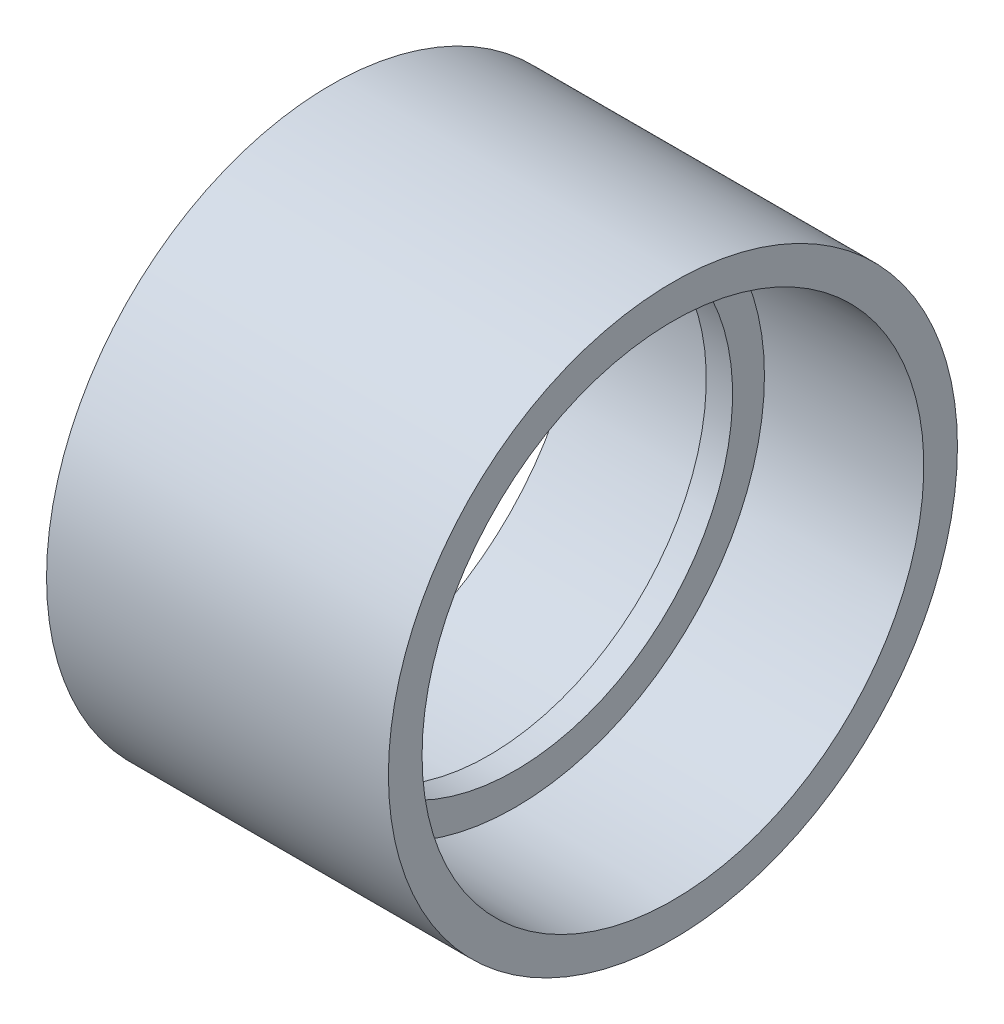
ISO-10303-21;
HEADER;
FILE_DESCRIPTION(('STEP AP214'),'2;1');
FILE_NAME('part.step','',(''),(''),'','','');
FILE_SCHEMA(('AUTOMOTIVE_DESIGN { 1 0 10303 214 1 1 1 1 }'));
ENDSEC;
DATA;
#1=APPLICATION_CONTEXT('core data for automotive mechanical design processes');
#2=APPLICATION_PROTOCOL_DEFINITION('international standard','automotive_design',2000,#1);
#3=PRODUCT_CONTEXT('',#1,'mechanical');
#4=PRODUCT('Part','Part','',(#3));
#5=PRODUCT_RELATED_PRODUCT_CATEGORY('part','',(#4));
#6=PRODUCT_DEFINITION_FORMATION('','',#4);
#7=PRODUCT_DEFINITION_CONTEXT('part definition',#1,'design');
#8=PRODUCT_DEFINITION('design','',#6,#7);
#9=PRODUCT_DEFINITION_SHAPE('','',#8);
#10=(LENGTH_UNIT() NAMED_UNIT(*) SI_UNIT(.MILLI.,.METRE.));
#11=(NAMED_UNIT(*) PLANE_ANGLE_UNIT() SI_UNIT($,.RADIAN.));
#12=(NAMED_UNIT(*) SI_UNIT($,.STERADIAN.) SOLID_ANGLE_UNIT());
#13=UNCERTAINTY_MEASURE_WITH_UNIT(LENGTH_MEASURE(1.E-05),#10,'distance_accuracy_value','');
#14=(GEOMETRIC_REPRESENTATION_CONTEXT(3) GLOBAL_UNCERTAINTY_ASSIGNED_CONTEXT((#13)) GLOBAL_UNIT_ASSIGNED_CONTEXT((#10,
#11,#12)) REPRESENTATION_CONTEXT('',''));
#15=CARTESIAN_POINT('',(0.,0.,0.));
#16=DIRECTION('',(0.,0.,1.));
#17=DIRECTION('',(1.,0.,0.));
#18=AXIS2_PLACEMENT_3D('',#15,#16,#17);
#19=CARTESIAN_POINT('',(-20.6375,-34.3535,0.));
#20=DIRECTION('',(-1.,0.,0.));
#21=DIRECTION('',(0.,0.,1.));
#22=AXIS2_PLACEMENT_3D('',#19,#20,#21);
#23=PLANE('',#22);
#24=CARTESIAN_POINT('',(-20.6375,0.,0.));
#25=DIRECTION('',(-1.,0.,0.));
#26=DIRECTION('',(0.,0.,1.));
#27=AXIS2_PLACEMENT_3D('',#24,#25,#26);
#28=CIRCLE('',#27,34.3535);
#29=CARTESIAN_POINT('',(-20.6375,0.,34.3535));
#30=VERTEX_POINT('',#29);
#31=EDGE_CURVE('E66',#30,#30,#28,.T.);
#32=ORIENTED_EDGE('',*,*,#31,.T.);
#33=EDGE_LOOP('',(#32));
#34=FACE_BOUND('',#33,.T.);
#35=CARTESIAN_POINT('',(-20.6375,0.,0.));
#36=DIRECTION('',(-1.,0.,0.));
#37=DIRECTION('',(0.,0.,1.));
#38=AXIS2_PLACEMENT_3D('',#35,#36,#37);
#39=CIRCLE('',#38,30.2895);
#40=CARTESIAN_POINT('',(-20.6375,0.,30.2895));
#41=VERTEX_POINT('',#40);
#42=EDGE_CURVE('E10',#41,#41,#39,.T.);
#43=ORIENTED_EDGE('',*,*,#42,.F.);
#44=EDGE_LOOP('',(#43));
#45=FACE_BOUND('',#44,.T.);
#46=ADVANCED_FACE('F33',(#34,#45),#23,.T.);
#47=CARTESIAN_POINT('',(-1.5875,0.,0.));
#48=DIRECTION('',(-1.,0.,0.));
#49=DIRECTION('',(0.,0.,1.));
#50=AXIS2_PLACEMENT_3D('',#47,#48,#49);
#51=CONICAL_SURFACE('',#50,30.099,0.00999966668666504);
#52=ORIENTED_EDGE('',*,*,#42,.T.);
#53=EDGE_LOOP('',(#52));
#54=FACE_BOUND('',#53,.T.);
#55=CARTESIAN_POINT('',(-1.5875,0.,0.));
#56=DIRECTION('',(-1.,0.,0.));
#57=DIRECTION('',(0.,0.,1.));
#58=AXIS2_PLACEMENT_3D('',#55,#56,#57);
#59=CIRCLE('',#58,30.099);
#60=CARTESIAN_POINT('',(-1.5875,0.,30.099));
#61=VERTEX_POINT('',#60);
#62=EDGE_CURVE('E40',#61,#61,#59,.T.);
#63=ORIENTED_EDGE('',*,*,#62,.F.);
#64=EDGE_LOOP('',(#63));
#65=FACE_BOUND('',#64,.T.);
#66=ADVANCED_FACE('F85',(#54,#65),#51,.F.);
#67=CARTESIAN_POINT('',(-1.5875,-26.2509,0.));
#68=DIRECTION('',(-1.,0.,0.));
#69=DIRECTION('',(0.,0.,1.));
#70=AXIS2_PLACEMENT_3D('',#67,#68,#69);
#71=PLANE('',#70);
#72=ORIENTED_EDGE('',*,*,#62,.T.);
#73=EDGE_LOOP('',(#72));
#74=FACE_BOUND('',#73,.T.);
#75=CARTESIAN_POINT('',(-1.5875,0.,0.));
#76=DIRECTION('',(-1.,0.,0.));
#77=DIRECTION('',(0.,0.,1.));
#78=AXIS2_PLACEMENT_3D('',#75,#76,#77);
#79=CIRCLE('',#78,26.2509);
#80=CARTESIAN_POINT('',(-1.5875,0.,26.2509));
#81=VERTEX_POINT('',#80);
#82=EDGE_CURVE('E47',#81,#81,#79,.T.);
#83=ORIENTED_EDGE('',*,*,#82,.F.);
#84=EDGE_LOOP('',(#83));
#85=FACE_BOUND('',#84,.T.);
#86=ADVANCED_FACE('F89',(#74,#85),#71,.T.);
#87=CARTESIAN_POINT('',(-20.6375,0.,0.));
#88=DIRECTION('',(-1.,0.,0.));
#89=DIRECTION('',(0.,0.,1.));
#90=AXIS2_PLACEMENT_3D('',#87,#88,#89);
#91=CYLINDRICAL_SURFACE('',#90,26.2509);
#92=ORIENTED_EDGE('',*,*,#82,.T.);
#93=EDGE_LOOP('',(#92));
#94=FACE_BOUND('',#93,.T.);
#95=CARTESIAN_POINT('',(1.5875,0.,0.));
#96=DIRECTION('',(-1.,0.,0.));
#97=DIRECTION('',(0.,0.,1.));
#98=AXIS2_PLACEMENT_3D('',#95,#96,#97);
#99=CIRCLE('',#98,26.2509);
#100=CARTESIAN_POINT('',(1.5875,0.,26.2509));
#101=VERTEX_POINT('',#100);
#102=EDGE_CURVE('E51',#101,#101,#99,.T.);
#103=ORIENTED_EDGE('',*,*,#102,.F.);
#104=EDGE_LOOP('',(#103));
#105=FACE_BOUND('',#104,.T.);
#106=ADVANCED_FACE('F93',(#94,#105),#91,.F.);
#107=CARTESIAN_POINT('',(1.5875,-26.2509,0.));
#108=DIRECTION('',(1.,0.,0.));
#109=DIRECTION('',(0.,0.,-1.));
#110=AXIS2_PLACEMENT_3D('',#107,#108,#109);
#111=PLANE('',#110);
#112=ORIENTED_EDGE('',*,*,#102,.T.);
#113=EDGE_LOOP('',(#112));
#114=FACE_BOUND('',#113,.T.);
#115=CARTESIAN_POINT('',(1.5875,0.,0.));
#116=DIRECTION('',(-1.,0.,0.));
#117=DIRECTION('',(0.,0.,1.));
#118=AXIS2_PLACEMENT_3D('',#115,#116,#117);
#119=CIRCLE('',#118,30.099);
#120=CARTESIAN_POINT('',(1.5875,0.,30.099));
#121=VERTEX_POINT('',#120);
#122=EDGE_CURVE('E56',#121,#121,#119,.T.);
#123=ORIENTED_EDGE('',*,*,#122,.F.);
#124=EDGE_LOOP('',(#123));
#125=FACE_BOUND('',#124,.T.);
#126=ADVANCED_FACE('F99',(#114,#125),#111,.T.);
#127=CARTESIAN_POINT('',(20.6375,0.,0.));
#128=DIRECTION('',(1.,0.,0.));
#129=DIRECTION('',(0.,0.,-1.));
#130=AXIS2_PLACEMENT_3D('',#127,#128,#129);
#131=CONICAL_SURFACE('',#130,30.2895,0.00999966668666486);
#132=ORIENTED_EDGE('',*,*,#122,.T.);
#133=EDGE_LOOP('',(#132));
#134=FACE_BOUND('',#133,.T.);
#135=CARTESIAN_POINT('',(20.6375,0.,0.));
#136=DIRECTION('',(-1.,0.,0.));
#137=DIRECTION('',(0.,0.,1.));
#138=AXIS2_PLACEMENT_3D('',#135,#136,#137);
#139=CIRCLE('',#138,30.2895);
#140=CARTESIAN_POINT('',(20.6375,0.,30.2895));
#141=VERTEX_POINT('',#140);
#142=EDGE_CURVE('E60',#141,#141,#139,.T.);
#143=ORIENTED_EDGE('',*,*,#142,.F.);
#144=EDGE_LOOP('',(#143));
#145=FACE_BOUND('',#144,.T.);
#146=ADVANCED_FACE('F81',(#134,#145),#131,.F.);
#147=CARTESIAN_POINT('',(20.6375,-34.3535,0.));
#148=DIRECTION('',(1.,0.,0.));
#149=DIRECTION('',(0.,0.,-1.));
#150=AXIS2_PLACEMENT_3D('',#147,#148,#149);
#151=PLANE('',#150);
#152=ORIENTED_EDGE('',*,*,#142,.T.);
#153=EDGE_LOOP('',(#152));
#154=FACE_BOUND('',#153,.T.);
#155=CARTESIAN_POINT('',(20.6375,0.,0.));
#156=DIRECTION('',(-1.,0.,0.));
#157=DIRECTION('',(0.,0.,1.));
#158=AXIS2_PLACEMENT_3D('',#155,#156,#157);
#159=CIRCLE('',#158,34.3535);
#160=CARTESIAN_POINT('',(20.6375,0.,34.3535));
#161=VERTEX_POINT('',#160);
#162=EDGE_CURVE('E63',#161,#161,#159,.T.);
#163=ORIENTED_EDGE('',*,*,#162,.F.);
#164=EDGE_LOOP('',(#163));
#165=FACE_BOUND('',#164,.T.);
#166=ADVANCED_FACE('F76',(#154,#165),#151,.T.);
#167=CARTESIAN_POINT('',(-20.6375,0.,0.));
#168=DIRECTION('',(-1.,0.,0.));
#169=DIRECTION('',(0.,0.,1.));
#170=AXIS2_PLACEMENT_3D('',#167,#168,#169);
#171=CYLINDRICAL_SURFACE('',#170,34.3535);
#172=ORIENTED_EDGE('',*,*,#162,.T.);
#173=EDGE_LOOP('',(#172));
#174=FACE_BOUND('',#173,.T.);
#175=ORIENTED_EDGE('',*,*,#31,.F.);
#176=EDGE_LOOP('',(#175));
#177=FACE_BOUND('',#176,.T.);
#178=ADVANCED_FACE('F74',(#174,#177),#171,.T.);
#179=CLOSED_SHELL('',(#46,#66,#86,#106,#126,#146,#166,#178));
#180=MANIFOLD_SOLID_BREP('B2',#179);
#181=ADVANCED_BREP_SHAPE_REPRESENTATION('',(#18,#180),#14);
#182=SHAPE_DEFINITION_REPRESENTATION(#9,#181);
ENDSEC;
END-ISO-10303-21;
